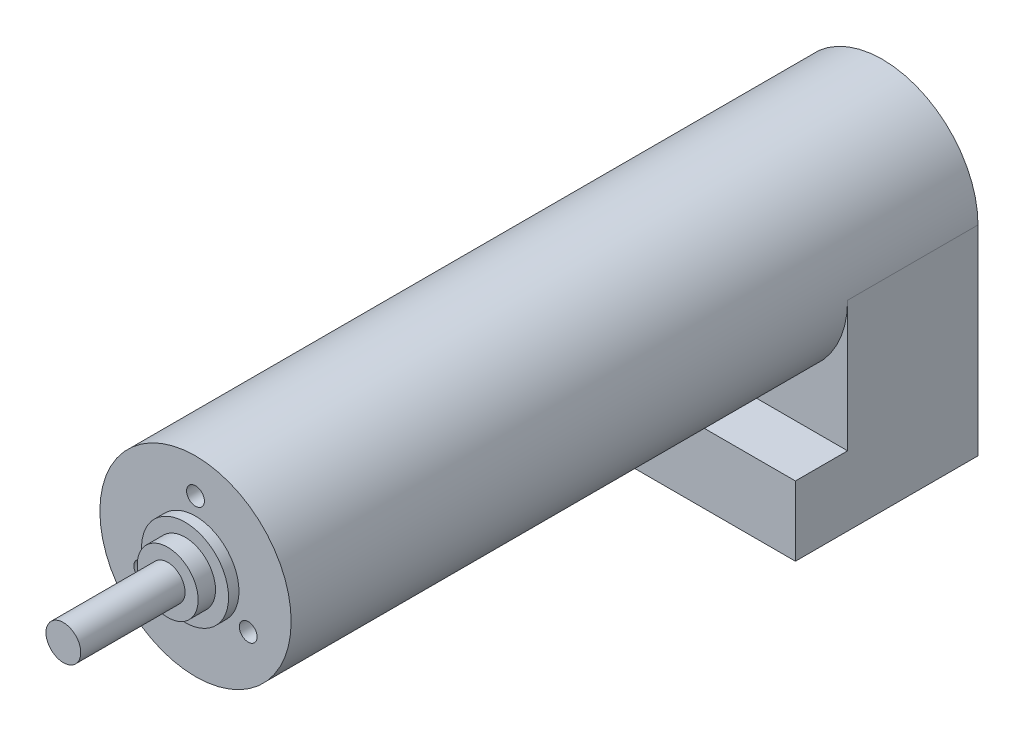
from build123d import *
from build123d.topology import SkipClean

# Parameters (mm, degrees)
SKETCH_2_R           = 11
EXTRUDE_1_DEPTH      = 64
EXTRUDE_START        = 15
EXTRUDE_2_DEPTH      = 15
SKETCH_4_W           = 22
SKETCH_4_H           = 8
EXTRUDE_3_DEPTH      = 21
HOLE_WIZARD_M2_5_1_D = 2.05
SKETCH_7_R           = 5
EXTRUDE_4_DEPTH      = 1.2
SKETCH_8_R           = 3.5
EXTRUDE_5_DEPTH      = 2
SKETCH_9_R           = 2
EXTRUDE_6_DEPTH      = 12


with BuildPart() as part:
    # Sketch 2 → Extrude 1 (new body)
    with BuildSketch(Plane.XY):
        Circle(SKETCH_2_R)
    extrude(amount=EXTRUDE_1_DEPTH)

    # Sketch 3 → Extrude 2 (add)
    with SkipClean():  # the faces are left unmerged after this step: merging them gives an invalid solid
        with BuildSketch(Plane(origin=(0, 0, 0), x_dir=(-1, 0, 0), z_dir=(0, 0, -1)).offset(EXTRUDE_START)):
            with BuildLine():
                Line((-11, 0), (-11, -23))
                Line((-11, -23), (11, -23))
                Line((11, -23), (11, 0))
                ThreePointArc((11, 0), (0, 11), (-11, 0))
            make_face()
        extrude(amount=-EXTRUDE_2_DEPTH)

    # Sketch 4 → Extrude 3 (add)
    with SkipClean():  # the faces are left unmerged after this step: merging them gives an invalid solid
        with BuildSketch(Plane(origin=(0, 0, -15), x_dir=(-1, 0, 0), z_dir=(0, 0, -1))):
            with Locations((0, -19)):
                Rectangle(SKETCH_4_W, SKETCH_4_H)
        extrude(amount=-EXTRUDE_3_DEPTH)

    # Hole Wizard M2.5 _1 (through all)
    with Locations(Plane.XY.offset(64)):
        with Locations((-6.062177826, -3.5), (0, 7), (6.062177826, -3.5)):
            Hole(HOLE_WIZARD_M2_5_1_D / 2)

    # Sketch 7 → Extrude 4 (add)
    with SkipClean():  # the faces are left unmerged after this step: merging them gives an invalid solid
        with BuildSketch(Plane.XY.offset(64)):
            Circle(SKETCH_7_R)
        extrude(amount=EXTRUDE_4_DEPTH)

    # Sketch 8 → Extrude 5 (add)
    with SkipClean():  # the faces are left unmerged after this step: merging them gives an invalid solid
        with BuildSketch(Plane.XY.offset(65.2)):
            Circle(SKETCH_8_R)
        extrude(amount=EXTRUDE_5_DEPTH)

    # Sketch 9 → Extrude 6 (add)
    with SkipClean():  # the faces are left unmerged after this step: merging them gives an invalid solid
        with BuildSketch(Plane.XY.offset(67.2)):
            Circle(SKETCH_9_R)
        extrude(amount=EXTRUDE_6_DEPTH)


solid = part.part
